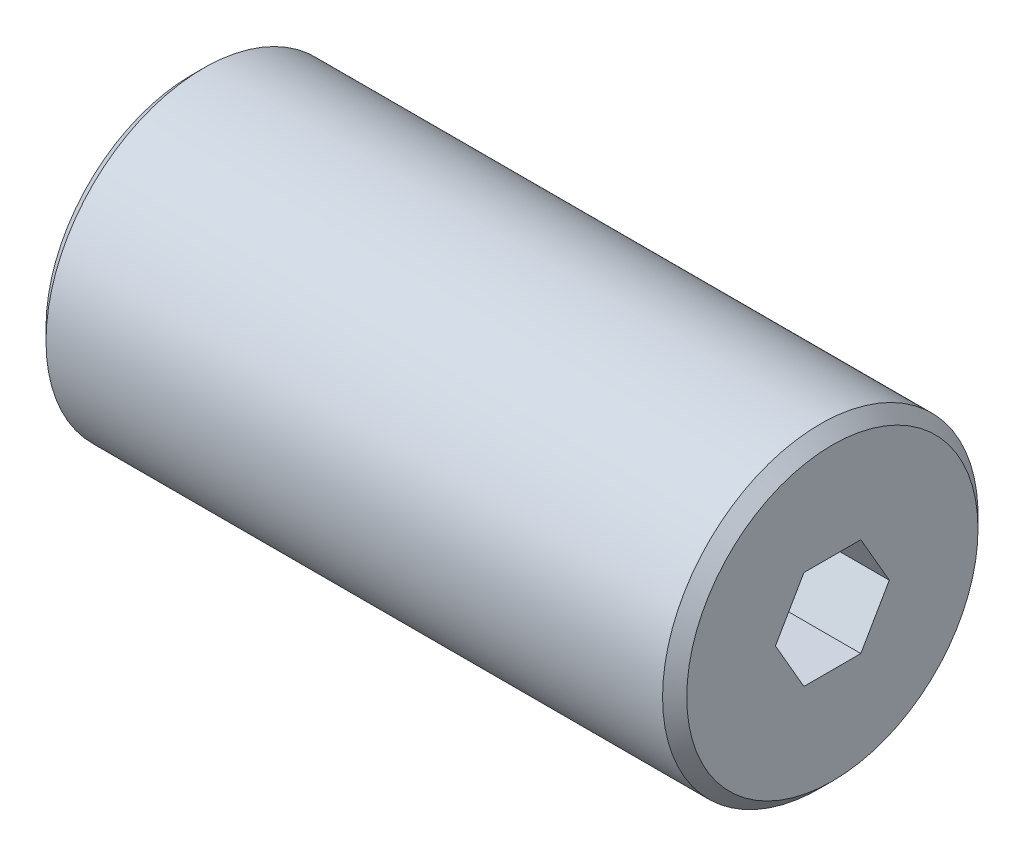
ISO-10303-21;
HEADER;
FILE_DESCRIPTION(('STEP AP214'),'2;1');
FILE_NAME('part.step','',(''),(''),'','','');
FILE_SCHEMA(('AUTOMOTIVE_DESIGN { 1 0 10303 214 1 1 1 1 }'));
ENDSEC;
DATA;
#1=APPLICATION_CONTEXT('core data for automotive mechanical design processes');
#2=APPLICATION_PROTOCOL_DEFINITION('international standard','automotive_design',2000,#1);
#3=PRODUCT_CONTEXT('',#1,'mechanical');
#4=PRODUCT('Part','Part','',(#3));
#5=PRODUCT_RELATED_PRODUCT_CATEGORY('part','',(#4));
#6=PRODUCT_DEFINITION_FORMATION('','',#4);
#7=PRODUCT_DEFINITION_CONTEXT('part definition',#1,'design');
#8=PRODUCT_DEFINITION('design','',#6,#7);
#9=PRODUCT_DEFINITION_SHAPE('','',#8);
#10=(LENGTH_UNIT() NAMED_UNIT(*) SI_UNIT(.MILLI.,.METRE.));
#11=(NAMED_UNIT(*) PLANE_ANGLE_UNIT() SI_UNIT($,.RADIAN.));
#12=(NAMED_UNIT(*) SI_UNIT($,.STERADIAN.) SOLID_ANGLE_UNIT());
#13=UNCERTAINTY_MEASURE_WITH_UNIT(LENGTH_MEASURE(1.E-05),#10,'distance_accuracy_value','');
#14=(GEOMETRIC_REPRESENTATION_CONTEXT(3) GLOBAL_UNCERTAINTY_ASSIGNED_CONTEXT((#13)) GLOBAL_UNIT_ASSIGNED_CONTEXT((#10,
#11,#12)) REPRESENTATION_CONTEXT('',''));
#15=CARTESIAN_POINT('',(0.,0.,0.));
#16=DIRECTION('',(0.,0.,1.));
#17=DIRECTION('',(1.,0.,0.));
#18=AXIS2_PLACEMENT_3D('',#15,#16,#17);
#19=CARTESIAN_POINT('',(28.5,0.,2.8867513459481));
#20=DIRECTION('',(1.,0.,0.));
#21=DIRECTION('',(0.,0.,-1.));
#22=AXIS2_PLACEMENT_3D('',#19,#20,#21);
#23=PLANE('',#22);
#24=DIRECTION('',(0.,-0.866025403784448,0.499999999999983));
#25=VECTOR('',#24,1.);
#26=CARTESIAN_POINT('',(28.5,2.5,1.4433756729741));
#27=LINE('',#26,#25);
#28=CARTESIAN_POINT('',(28.5,2.5,1.4433756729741));
#29=VERTEX_POINT('',#28);
#30=CARTESIAN_POINT('',(28.5,1.24999999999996,2.16506350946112));
#31=VERTEX_POINT('',#30);
#32=EDGE_CURVE('E151',#29,#31,#27,.T.);
#33=ORIENTED_EDGE('',*,*,#32,.T.);
#34=CARTESIAN_POINT('',(28.5,0.,0.));
#35=DIRECTION('',(-1.,0.,0.));
#36=DIRECTION('',(0.,0.,1.));
#37=AXIS2_PLACEMENT_3D('',#34,#35,#36);
#38=CIRCLE('',#37,2.5);
#39=CARTESIAN_POINT('',(28.5,2.5,0.));
#40=VERTEX_POINT('',#39);
#41=EDGE_CURVE('E42',#31,#40,#38,.T.);
#42=ORIENTED_EDGE('',*,*,#41,.T.);
#43=DIRECTION('',(0.,0.,1.));
#44=VECTOR('',#43,1.);
#45=CARTESIAN_POINT('',(28.5,2.5,-1.4433756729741));
#46=LINE('',#45,#44);
#47=EDGE_CURVE('E163',#40,#29,#46,.T.);
#48=ORIENTED_EDGE('',*,*,#47,.T.);
#49=EDGE_LOOP('',(#33,#42,#48));
#50=FACE_BOUND('',#49,.T.);
#51=ADVANCED_FACE('F31',(#50),#23,.T.);
#52=CARTESIAN_POINT('',(28.5,2.5,-1.4433756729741));
#53=VERTEX_POINT('',#52);
#54=EDGE_CURVE('E164',#53,#40,#46,.T.);
#55=ORIENTED_EDGE('',*,*,#54,.T.);
#56=CARTESIAN_POINT('',(28.5,1.24999999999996,-2.16506350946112));
#57=VERTEX_POINT('',#56);
#58=EDGE_CURVE('E11',#40,#57,#38,.T.);
#59=ORIENTED_EDGE('',*,*,#58,.T.);
#60=DIRECTION('',(0.,0.866025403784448,0.499999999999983));
#61=VECTOR('',#60,1.);
#62=CARTESIAN_POINT('',(28.5,0.,-2.8867513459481));
#63=LINE('',#62,#61);
#64=EDGE_CURVE('E159',#57,#53,#63,.T.);
#65=ORIENTED_EDGE('',*,*,#64,.T.);
#66=EDGE_LOOP('',(#55,#59,#65));
#67=FACE_BOUND('',#66,.T.);
#68=ADVANCED_FACE('F118',(#67),#23,.T.);
#69=CARTESIAN_POINT('',(28.5,0.,-2.8867513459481));
#70=VERTEX_POINT('',#69);
#71=EDGE_CURVE('E160',#70,#57,#63,.T.);
#72=ORIENTED_EDGE('',*,*,#71,.T.);
#73=CARTESIAN_POINT('',(28.5,-1.24999999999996,-2.16506350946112));
#74=VERTEX_POINT('',#73);
#75=EDGE_CURVE('E40',#57,#74,#38,.T.);
#76=ORIENTED_EDGE('',*,*,#75,.T.);
#77=DIRECTION('',(0.,0.866025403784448,-0.499999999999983));
#78=VECTOR('',#77,1.);
#79=CARTESIAN_POINT('',(28.5,-2.5,-1.4433756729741));
#80=LINE('',#79,#78);
#81=EDGE_CURVE('E155',#74,#70,#80,.T.);
#82=ORIENTED_EDGE('',*,*,#81,.T.);
#83=EDGE_LOOP('',(#72,#76,#82));
#84=FACE_BOUND('',#83,.T.);
#85=ADVANCED_FACE('F124',(#84),#23,.T.);
#86=CARTESIAN_POINT('',(28.5,-2.5,-1.4433756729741));
#87=VERTEX_POINT('',#86);
#88=EDGE_CURVE('E156',#87,#74,#80,.T.);
#89=ORIENTED_EDGE('',*,*,#88,.T.);
#90=CARTESIAN_POINT('',(28.5,-2.5,0.));
#91=VERTEX_POINT('',#90);
#92=EDGE_CURVE('E214',#74,#91,#38,.T.);
#93=ORIENTED_EDGE('',*,*,#92,.T.);
#94=DIRECTION('',(0.,0.,-1.));
#95=VECTOR('',#94,1.);
#96=CARTESIAN_POINT('',(28.5,-2.5,1.4433756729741));
#97=LINE('',#96,#95);
#98=EDGE_CURVE('E146',#91,#87,#97,.T.);
#99=ORIENTED_EDGE('',*,*,#98,.T.);
#100=EDGE_LOOP('',(#89,#93,#99));
#101=FACE_BOUND('',#100,.T.);
#102=ADVANCED_FACE('F137',(#101),#23,.T.);
#103=CARTESIAN_POINT('',(28.5,-2.5,1.4433756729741));
#104=VERTEX_POINT('',#103);
#105=EDGE_CURVE('E149',#104,#91,#97,.T.);
#106=ORIENTED_EDGE('',*,*,#105,.T.);
#107=CARTESIAN_POINT('',(28.5,-1.24999999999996,2.16506350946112));
#108=VERTEX_POINT('',#107);
#109=EDGE_CURVE('E212',#91,#108,#38,.T.);
#110=ORIENTED_EDGE('',*,*,#109,.T.);
#111=DIRECTION('',(0.,-0.866025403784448,-0.499999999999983));
#112=VECTOR('',#111,1.);
#113=CARTESIAN_POINT('',(28.5,0.,2.8867513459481));
#114=LINE('',#113,#112);
#115=EDGE_CURVE('E147',#108,#104,#114,.T.);
#116=ORIENTED_EDGE('',*,*,#115,.T.);
#117=EDGE_LOOP('',(#106,#110,#116));
#118=FACE_BOUND('',#117,.T.);
#119=ADVANCED_FACE('F129',(#118),#23,.T.);
#120=CARTESIAN_POINT('',(28.5,0.,2.8867513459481));
#121=VERTEX_POINT('',#120);
#122=EDGE_CURVE('E141',#121,#108,#114,.T.);
#123=ORIENTED_EDGE('',*,*,#122,.T.);
#124=EDGE_CURVE('E142',#108,#31,#38,.T.);
#125=ORIENTED_EDGE('',*,*,#124,.T.);
#126=EDGE_CURVE('E144',#31,#121,#27,.T.);
#127=ORIENTED_EDGE('',*,*,#126,.T.);
#128=EDGE_LOOP('',(#123,#125,#127));
#129=FACE_BOUND('',#128,.T.);
#130=ADVANCED_FACE('F120',(#129),#23,.T.);
#131=CARTESIAN_POINT('',(8.5,0.,0.));
#132=DIRECTION('',(1.,0.,0.));
#133=DIRECTION('',(0.,0.,-1.));
#134=AXIS2_PLACEMENT_3D('',#131,#132,#133);
#135=PLANE('',#134);
#136=CARTESIAN_POINT('',(8.5,0.,0.));
#137=DIRECTION('',(-1.,0.,0.));
#138=DIRECTION('',(0.,0.,1.));
#139=AXIS2_PLACEMENT_3D('',#136,#137,#138);
#140=CIRCLE('',#139,4.8);
#141=CARTESIAN_POINT('',(8.5,0.,4.8));
#142=VERTEX_POINT('',#141);
#143=EDGE_CURVE('E35',#142,#142,#140,.T.);
#144=ORIENTED_EDGE('',*,*,#143,.T.);
#145=EDGE_LOOP('',(#144));
#146=FACE_BOUND('',#145,.T.);
#147=ADVANCED_FACE('F33',(#146),#135,.F.);
#148=CARTESIAN_POINT('',(32.5,0.,0.));
#149=DIRECTION('',(-1.,0.,0.));
#150=DIRECTION('',(0.,0.,1.));
#151=AXIS2_PLACEMENT_3D('',#148,#149,#150);
#152=CYLINDRICAL_SURFACE('',#151,4.8);
#153=ORIENTED_EDGE('',*,*,#143,.F.);
#154=EDGE_LOOP('',(#153));
#155=FACE_BOUND('',#154,.T.);
#156=CARTESIAN_POINT('',(0.,0.,0.));
#157=DIRECTION('',(-1.,0.,0.));
#158=DIRECTION('',(0.,0.,1.));
#159=AXIS2_PLACEMENT_3D('',#156,#157,#158);
#160=CIRCLE('',#159,4.8);
#161=CARTESIAN_POINT('',(0.,0.,4.8));
#162=VERTEX_POINT('',#161);
#163=EDGE_CURVE('E206',#162,#162,#160,.T.);
#164=ORIENTED_EDGE('',*,*,#163,.T.);
#165=EDGE_LOOP('',(#164));
#166=FACE_BOUND('',#165,.T.);
#167=ADVANCED_FACE('F135',(#155,#166),#152,.F.);
#168=CARTESIAN_POINT('',(0.,4.8,0.));
#169=DIRECTION('',(1.,0.,0.));
#170=DIRECTION('',(0.,0.,-1.));
#171=AXIS2_PLACEMENT_3D('',#168,#169,#170);
#172=PLANE('',#171);
#173=ORIENTED_EDGE('',*,*,#163,.F.);
#174=EDGE_LOOP('',(#173));
#175=FACE_BOUND('',#174,.T.);
#176=CARTESIAN_POINT('',(0.,0.,0.));
#177=DIRECTION('',(-1.,0.,0.));
#178=DIRECTION('',(0.,0.,1.));
#179=AXIS2_PLACEMENT_3D('',#176,#177,#178);
#180=CIRCLE('',#179,7.3865);
#181=CARTESIAN_POINT('',(0.,0.,7.3865));
#182=VERTEX_POINT('',#181);
#183=EDGE_CURVE('E204',#182,#182,#180,.T.);
#184=ORIENTED_EDGE('',*,*,#183,.T.);
#185=EDGE_LOOP('',(#184));
#186=FACE_BOUND('',#185,.T.);
#187=ADVANCED_FACE('F257',(#175,#186),#172,.F.);
#188=CARTESIAN_POINT('',(0.613500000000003,0.,0.));
#189=DIRECTION('',(1.,0.,0.));
#190=DIRECTION('',(0.,0.,-1.));
#191=AXIS2_PLACEMENT_3D('',#188,#189,#190);
#192=CONICAL_SURFACE('',#191,8.,0.785398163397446);
#193=ORIENTED_EDGE('',*,*,#183,.F.);
#194=EDGE_LOOP('',(#193));
#195=FACE_BOUND('',#194,.T.);
#196=CARTESIAN_POINT('',(0.613500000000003,0.,0.));
#197=DIRECTION('',(-1.,0.,0.));
#198=DIRECTION('',(0.,0.,1.));
#199=AXIS2_PLACEMENT_3D('',#196,#197,#198);
#200=CIRCLE('',#199,8.);
#201=CARTESIAN_POINT('',(0.613500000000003,0.,8.));
#202=VERTEX_POINT('',#201);
#203=EDGE_CURVE('E201',#202,#202,#200,.T.);
#204=ORIENTED_EDGE('',*,*,#203,.T.);
#205=EDGE_LOOP('',(#204));
#206=FACE_BOUND('',#205,.T.);
#207=ADVANCED_FACE('F253',(#195,#206),#192,.T.);
#208=CARTESIAN_POINT('',(32.5,0.,0.));
#209=DIRECTION('',(-1.,0.,0.));
#210=DIRECTION('',(0.,0.,1.));
#211=AXIS2_PLACEMENT_3D('',#208,#209,#210);
#212=CYLINDRICAL_SURFACE('',#211,8.);
#213=ORIENTED_EDGE('',*,*,#203,.F.);
#214=EDGE_LOOP('',(#213));
#215=FACE_BOUND('',#214,.T.);
#216=CARTESIAN_POINT('',(31.8865,0.,0.));
#217=DIRECTION('',(-1.,0.,0.));
#218=DIRECTION('',(0.,0.,1.));
#219=AXIS2_PLACEMENT_3D('',#216,#217,#218);
#220=CIRCLE('',#219,8.);
#221=CARTESIAN_POINT('',(31.8865,0.,8.));
#222=VERTEX_POINT('',#221);
#223=EDGE_CURVE('E198',#222,#222,#220,.T.);
#224=ORIENTED_EDGE('',*,*,#223,.T.);
#225=EDGE_LOOP('',(#224));
#226=FACE_BOUND('',#225,.T.);
#227=ADVANCED_FACE('F249',(#215,#226),#212,.T.);
#228=CARTESIAN_POINT('',(32.5,0.,0.));
#229=DIRECTION('',(-1.,0.,0.));
#230=DIRECTION('',(0.,0.,1.));
#231=AXIS2_PLACEMENT_3D('',#228,#229,#230);
#232=CONICAL_SURFACE('',#231,7.3865,0.785398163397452);
#233=ORIENTED_EDGE('',*,*,#223,.F.);
#234=EDGE_LOOP('',(#233));
#235=FACE_BOUND('',#234,.T.);
#236=CARTESIAN_POINT('',(32.5,0.,0.));
#237=DIRECTION('',(-1.,0.,0.));
#238=DIRECTION('',(0.,0.,1.));
#239=AXIS2_PLACEMENT_3D('',#236,#237,#238);
#240=CIRCLE('',#239,7.3865);
#241=CARTESIAN_POINT('',(32.5,0.,7.3865));
#242=VERTEX_POINT('',#241);
#243=EDGE_CURVE('E186',#242,#242,#240,.T.);
#244=ORIENTED_EDGE('',*,*,#243,.T.);
#245=EDGE_LOOP('',(#244));
#246=FACE_BOUND('',#245,.T.);
#247=ADVANCED_FACE('F243',(#235,#246),#232,.T.);
#248=CARTESIAN_POINT('',(32.5,7.3865,0.));
#249=DIRECTION('',(-1.,0.,0.));
#250=DIRECTION('',(0.,0.,1.));
#251=AXIS2_PLACEMENT_3D('',#248,#249,#250);
#252=PLANE('',#251);
#253=DIRECTION('',(0.,-0.866025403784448,-0.499999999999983));
#254=VECTOR('',#253,1.);
#255=CARTESIAN_POINT('',(32.5,0.,2.8867513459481));
#256=LINE('',#255,#254);
#257=CARTESIAN_POINT('',(32.5,0.,2.8867513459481));
#258=VERTEX_POINT('',#257);
#259=CARTESIAN_POINT('',(32.5,-2.5,1.4433756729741));
#260=VERTEX_POINT('',#259);
#261=EDGE_CURVE('E169',#258,#260,#256,.T.);
#262=ORIENTED_EDGE('',*,*,#261,.F.);
#263=DIRECTION('',(0.,-0.866025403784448,0.499999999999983));
#264=VECTOR('',#263,1.);
#265=CARTESIAN_POINT('',(32.5,2.5,1.4433756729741));
#266=LINE('',#265,#264);
#267=CARTESIAN_POINT('',(32.5,2.5,1.4433756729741));
#268=VERTEX_POINT('',#267);
#269=EDGE_CURVE('E56',#268,#258,#266,.T.);
#270=ORIENTED_EDGE('',*,*,#269,.F.);
#271=DIRECTION('',(0.,0.,1.));
#272=VECTOR('',#271,1.);
#273=CARTESIAN_POINT('',(32.5,2.5,-1.4433756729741));
#274=LINE('',#273,#272);
#275=CARTESIAN_POINT('',(32.5,2.5,-1.4433756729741));
#276=VERTEX_POINT('',#275);
#277=EDGE_CURVE('E181',#276,#268,#274,.T.);
#278=ORIENTED_EDGE('',*,*,#277,.F.);
#279=DIRECTION('',(0.,0.866025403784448,0.499999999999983));
#280=VECTOR('',#279,1.);
#281=CARTESIAN_POINT('',(32.5,0.,-2.8867513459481));
#282=LINE('',#281,#280);
#283=CARTESIAN_POINT('',(32.5,0.,-2.8867513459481));
#284=VERTEX_POINT('',#283);
#285=EDGE_CURVE('E178',#284,#276,#282,.T.);
#286=ORIENTED_EDGE('',*,*,#285,.F.);
#287=DIRECTION('',(0.,0.866025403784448,-0.499999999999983));
#288=VECTOR('',#287,1.);
#289=CARTESIAN_POINT('',(32.5,-2.5,-1.4433756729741));
#290=LINE('',#289,#288);
#291=CARTESIAN_POINT('',(32.5,-2.5,-1.4433756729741));
#292=VERTEX_POINT('',#291);
#293=EDGE_CURVE('E175',#292,#284,#290,.T.);
#294=ORIENTED_EDGE('',*,*,#293,.F.);
#295=DIRECTION('',(0.,0.,-1.));
#296=VECTOR('',#295,1.);
#297=CARTESIAN_POINT('',(32.5,-2.5,1.4433756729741));
#298=LINE('',#297,#296);
#299=EDGE_CURVE('E172',#260,#292,#298,.T.);
#300=ORIENTED_EDGE('',*,*,#299,.F.);
#301=EDGE_LOOP('',(#262,#270,#278,#286,#294,#300));
#302=FACE_BOUND('',#301,.T.);
#303=ORIENTED_EDGE('',*,*,#243,.F.);
#304=EDGE_LOOP('',(#303));
#305=FACE_BOUND('',#304,.T.);
#306=ADVANCED_FACE('F230',(#302,#305),#252,.F.);
#307=CARTESIAN_POINT('',(28.5,2.5,1.4433756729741));
#308=DIRECTION('',(0.,0.499999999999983,0.866025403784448));
#309=DIRECTION('',(0.,-0.866025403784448,0.499999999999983));
#310=AXIS2_PLACEMENT_3D('',#307,#308,#309);
#311=PLANE('',#310);
#312=ORIENTED_EDGE('',*,*,#269,.T.);
#313=DIRECTION('',(1.,0.,0.));
#314=VECTOR('',#313,1.);
#315=CARTESIAN_POINT('',(28.5,0.,2.8867513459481));
#316=LINE('',#315,#314);
#317=EDGE_CURVE('E167',#121,#258,#316,.T.);
#318=ORIENTED_EDGE('',*,*,#317,.F.);
#319=ORIENTED_EDGE('',*,*,#126,.F.);
#320=ORIENTED_EDGE('',*,*,#32,.F.);
#321=DIRECTION('',(1.,0.,0.));
#322=VECTOR('',#321,1.);
#323=CARTESIAN_POINT('',(28.5,2.5,1.4433756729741));
#324=LINE('',#323,#322);
#325=EDGE_CURVE('E184',#29,#268,#324,.T.);
#326=ORIENTED_EDGE('',*,*,#325,.T.);
#327=EDGE_LOOP('',(#312,#318,#319,#320,#326));
#328=FACE_BOUND('',#327,.T.);
#329=ADVANCED_FACE('F236',(#328),#311,.F.);
#330=CARTESIAN_POINT('',(28.5,2.5,-1.4433756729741));
#331=DIRECTION('',(0.,1.,0.));
#332=DIRECTION('',(0.,0.,1.));
#333=AXIS2_PLACEMENT_3D('',#330,#331,#332);
#334=PLANE('',#333);
#335=ORIENTED_EDGE('',*,*,#277,.T.);
#336=ORIENTED_EDGE('',*,*,#325,.F.);
#337=ORIENTED_EDGE('',*,*,#47,.F.);
#338=ORIENTED_EDGE('',*,*,#54,.F.);
#339=DIRECTION('',(1.,0.,0.));
#340=VECTOR('',#339,1.);
#341=CARTESIAN_POINT('',(28.5,2.5,-1.4433756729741));
#342=LINE('',#341,#340);
#343=EDGE_CURVE('E187',#53,#276,#342,.T.);
#344=ORIENTED_EDGE('',*,*,#343,.T.);
#345=EDGE_LOOP('',(#335,#336,#337,#338,#344));
#346=FACE_BOUND('',#345,.T.);
#347=ADVANCED_FACE('F220',(#346),#334,.F.);
#348=CARTESIAN_POINT('',(28.5,0.,-2.8867513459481));
#349=DIRECTION('',(0.,0.499999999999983,-0.866025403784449));
#350=DIRECTION('',(0.,0.866025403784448,0.499999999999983));
#351=AXIS2_PLACEMENT_3D('',#348,#349,#350);
#352=PLANE('',#351);
#353=ORIENTED_EDGE('',*,*,#285,.T.);
#354=ORIENTED_EDGE('',*,*,#343,.F.);
#355=ORIENTED_EDGE('',*,*,#64,.F.);
#356=ORIENTED_EDGE('',*,*,#71,.F.);
#357=DIRECTION('',(1.,0.,0.));
#358=VECTOR('',#357,1.);
#359=CARTESIAN_POINT('',(28.5,0.,-2.8867513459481));
#360=LINE('',#359,#358);
#361=EDGE_CURVE('E189',#70,#284,#360,.T.);
#362=ORIENTED_EDGE('',*,*,#361,.T.);
#363=EDGE_LOOP('',(#353,#354,#355,#356,#362));
#364=FACE_BOUND('',#363,.T.);
#365=ADVANCED_FACE('F225',(#364),#352,.F.);
#366=CARTESIAN_POINT('',(28.5,-2.5,-1.4433756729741));
#367=DIRECTION('',(0.,-0.499999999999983,-0.866025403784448));
#368=DIRECTION('',(0.,0.866025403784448,-0.499999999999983));
#369=AXIS2_PLACEMENT_3D('',#366,#367,#368);
#370=PLANE('',#369);
#371=ORIENTED_EDGE('',*,*,#293,.T.);
#372=ORIENTED_EDGE('',*,*,#361,.F.);
#373=ORIENTED_EDGE('',*,*,#81,.F.);
#374=ORIENTED_EDGE('',*,*,#88,.F.);
#375=DIRECTION('',(1.,0.,0.));
#376=VECTOR('',#375,1.);
#377=CARTESIAN_POINT('',(28.5,-2.5,-1.4433756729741));
#378=LINE('',#377,#376);
#379=EDGE_CURVE('E191',#87,#292,#378,.T.);
#380=ORIENTED_EDGE('',*,*,#379,.T.);
#381=EDGE_LOOP('',(#371,#372,#373,#374,#380));
#382=FACE_BOUND('',#381,.T.);
#383=ADVANCED_FACE('F344',(#382),#370,.F.);
#384=CARTESIAN_POINT('',(28.5,-2.5,1.4433756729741));
#385=DIRECTION('',(0.,-1.,0.));
#386=DIRECTION('',(0.,0.,-1.));
#387=AXIS2_PLACEMENT_3D('',#384,#385,#386);
#388=PLANE('',#387);
#389=ORIENTED_EDGE('',*,*,#299,.T.);
#390=ORIENTED_EDGE('',*,*,#379,.F.);
#391=ORIENTED_EDGE('',*,*,#98,.F.);
#392=ORIENTED_EDGE('',*,*,#105,.F.);
#393=DIRECTION('',(1.,0.,0.));
#394=VECTOR('',#393,1.);
#395=CARTESIAN_POINT('',(28.5,-2.5,1.4433756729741));
#396=LINE('',#395,#394);
#397=EDGE_CURVE('E193',#104,#260,#396,.T.);
#398=ORIENTED_EDGE('',*,*,#397,.T.);
#399=EDGE_LOOP('',(#389,#390,#391,#392,#398));
#400=FACE_BOUND('',#399,.T.);
#401=ADVANCED_FACE('F113',(#400),#388,.F.);
#402=CARTESIAN_POINT('',(28.5,0.,2.8867513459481));
#403=DIRECTION('',(0.,-0.499999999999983,0.866025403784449));
#404=DIRECTION('',(0.,-0.866025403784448,-0.499999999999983));
#405=AXIS2_PLACEMENT_3D('',#402,#403,#404);
#406=PLANE('',#405);
#407=ORIENTED_EDGE('',*,*,#261,.T.);
#408=ORIENTED_EDGE('',*,*,#397,.F.);
#409=ORIENTED_EDGE('',*,*,#115,.F.);
#410=ORIENTED_EDGE('',*,*,#122,.F.);
#411=ORIENTED_EDGE('',*,*,#317,.T.);
#412=EDGE_LOOP('',(#407,#408,#409,#410,#411));
#413=FACE_BOUND('',#412,.T.);
#414=ADVANCED_FACE('F108',(#413),#406,.F.);
#415=CARTESIAN_POINT('',(28.5,0.,0.));
#416=DIRECTION('',(1.,0.,0.));
#417=DIRECTION('',(0.,0.,-1.));
#418=AXIS2_PLACEMENT_3D('',#415,#416,#417);
#419=CONICAL_SURFACE('',#418,2.5,1.04719755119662);
#420=CARTESIAN_POINT('',(27.056624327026,0.,0.));
#421=VERTEX_POINT('',#420);
#422=VERTEX_LOOP('',#421);
#423=FACE_BOUND('',#422,.T.);
#424=ORIENTED_EDGE('',*,*,#41,.F.);
#425=ORIENTED_EDGE('',*,*,#124,.F.);
#426=ORIENTED_EDGE('',*,*,#109,.F.);
#427=ORIENTED_EDGE('',*,*,#92,.F.);
#428=ORIENTED_EDGE('',*,*,#75,.F.);
#429=ORIENTED_EDGE('',*,*,#58,.F.);
#430=EDGE_LOOP('',(#424,#425,#426,#427,#428,#429));
#431=FACE_BOUND('',#430,.T.);
#432=ADVANCED_FACE('F106',(#423,#431),#419,.F.);
#433=CLOSED_SHELL('',(#51,#68,#85,#102,#119,#130,#147,#167,#187,#207,#227,#247,#306,#329,#347,
#365,#383,#401,#414,#432));
#434=MANIFOLD_SOLID_BREP('B2',#433);
#435=ADVANCED_BREP_SHAPE_REPRESENTATION('',(#18,#434),#14);
#436=SHAPE_DEFINITION_REPRESENTATION(#9,#435);
ENDSEC;
END-ISO-10303-21;
